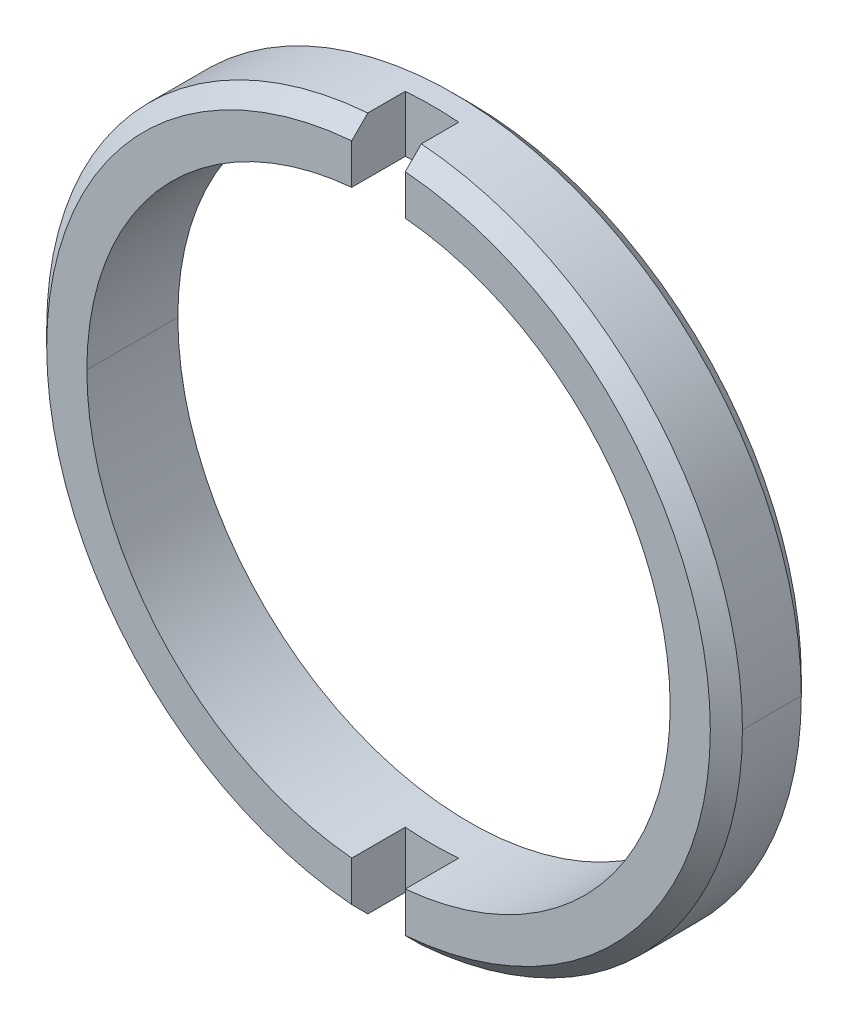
ISO-10303-21;
HEADER;
FILE_DESCRIPTION(('STEP AP214'),'2;1');
FILE_NAME('part.step','',(''),(''),'','','');
FILE_SCHEMA(('AUTOMOTIVE_DESIGN { 1 0 10303 214 1 1 1 1 }'));
ENDSEC;
DATA;
#1=APPLICATION_CONTEXT('core data for automotive mechanical design processes');
#2=APPLICATION_PROTOCOL_DEFINITION('international standard','automotive_design',2000,#1);
#3=PRODUCT_CONTEXT('',#1,'mechanical');
#4=PRODUCT('Part','Part','',(#3));
#5=PRODUCT_RELATED_PRODUCT_CATEGORY('part','',(#4));
#6=PRODUCT_DEFINITION_FORMATION('','',#4);
#7=PRODUCT_DEFINITION_CONTEXT('part definition',#1,'design');
#8=PRODUCT_DEFINITION('design','',#6,#7);
#9=PRODUCT_DEFINITION_SHAPE('','',#8);
#10=(LENGTH_UNIT() NAMED_UNIT(*) SI_UNIT(.MILLI.,.METRE.));
#11=(NAMED_UNIT(*) PLANE_ANGLE_UNIT() SI_UNIT($,.RADIAN.));
#12=(NAMED_UNIT(*) SI_UNIT($,.STERADIAN.) SOLID_ANGLE_UNIT());
#13=UNCERTAINTY_MEASURE_WITH_UNIT(LENGTH_MEASURE(1.E-05),#10,'distance_accuracy_value','');
#14=(GEOMETRIC_REPRESENTATION_CONTEXT(3) GLOBAL_UNCERTAINTY_ASSIGNED_CONTEXT((#13)) GLOBAL_UNIT_ASSIGNED_CONTEXT((#10,
#11,#12)) REPRESENTATION_CONTEXT('',''));
#15=CARTESIAN_POINT('',(0.,0.,0.));
#16=DIRECTION('',(0.,0.,1.));
#17=DIRECTION('',(1.,0.,0.));
#18=AXIS2_PLACEMENT_3D('',#15,#16,#17);
#19=CARTESIAN_POINT('',(0.,0.,1.7));
#20=DIRECTION('',(0.,0.,-1.));
#21=DIRECTION('',(-1.,0.,0.));
#22=AXIS2_PLACEMENT_3D('',#19,#20,#21);
#23=CONICAL_SURFACE('',#22,6.2,0.78539816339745);
#24=DIRECTION('',(-0.707106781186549,0.,-0.707106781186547));
#25=VECTOR('',#24,1.);
#26=CARTESIAN_POINT('',(-6.2,0.,1.7));
#27=LINE('',#26,#25);
#28=CARTESIAN_POINT('',(-6.2,0.,1.7));
#29=VERTEX_POINT('',#28);
#30=CARTESIAN_POINT('',(-6.5,0.,1.4));
#31=VERTEX_POINT('',#30);
#32=EDGE_CURVE('E280',#29,#31,#27,.T.);
#33=ORIENTED_EDGE('',*,*,#32,.F.);
#34=CARTESIAN_POINT('',(0.,0.,1.7));
#35=DIRECTION('',(0.,0.,1.));
#36=DIRECTION('',(1.,0.,0.));
#37=AXIS2_PLACEMENT_3D('',#34,#35,#36);
#38=CIRCLE('',#37,6.2);
#39=CARTESIAN_POINT('',(-0.5,6.17980582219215,1.7));
#40=VERTEX_POINT('',#39);
#41=EDGE_CURVE('E263',#40,#29,#38,.T.);
#42=ORIENTED_EDGE('',*,*,#41,.F.);
#43=CARTESIAN_POINT('',(-0.5,6.48074069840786,1.4));
#44=CARTESIAN_POINT('',(-0.5,6.38043627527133,1.5000072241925));
#45=CARTESIAN_POINT('',(-0.5,6.28012499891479,1.60000757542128));
#46=CARTESIAN_POINT('',(-0.5,6.17980582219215,1.7));
#47=(BOUNDED_CURVE() B_SPLINE_CURVE(3,(#43,#44,#45,#46),.UNSPECIFIED.,.F.,
.F.) B_SPLINE_CURVE_WITH_KNOTS((4,4),(0.,0.000424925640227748),
.UNSPECIFIED.) CURVE() GEOMETRIC_REPRESENTATION_ITEM() RATIONAL_B_SPLINE_CURVE((1.,1.,1.,1.)) REPRESENTATION_ITEM(''));
#48=CARTESIAN_POINT('',(-0.5,6.48074069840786,1.4));
#49=VERTEX_POINT('',#48);
#50=EDGE_CURVE('E179',#49,#40,#47,.T.);
#51=ORIENTED_EDGE('',*,*,#50,.F.);
#52=CARTESIAN_POINT('',(0.,0.,1.4));
#53=DIRECTION('',(0.,0.,-1.));
#54=DIRECTION('',(1.,0.,0.));
#55=AXIS2_PLACEMENT_3D('',#52,#53,#54);
#56=CIRCLE('',#55,6.5);
#57=EDGE_CURVE('E193',#31,#49,#56,.T.);
#58=ORIENTED_EDGE('',*,*,#57,.F.);
#59=EDGE_LOOP('',(#33,#42,#51,#58));
#60=FACE_BOUND('',#59,.T.);
#61=ADVANCED_FACE('F15',(#60),#23,.T.);
#62=CARTESIAN_POINT('',(0.,0.,1.7));
#63=DIRECTION('',(0.,0.,-1.));
#64=DIRECTION('',(-1.,0.,0.));
#65=AXIS2_PLACEMENT_3D('',#62,#63,#64);
#66=CONICAL_SURFACE('',#65,6.2,0.78539816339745);
#67=CARTESIAN_POINT('',(0.5,-6.48074069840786,1.4));
#68=CARTESIAN_POINT('',(0.5,-6.38043627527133,1.5000072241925));
#69=CARTESIAN_POINT('',(0.5,-6.28012499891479,1.60000757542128));
#70=CARTESIAN_POINT('',(0.5,-6.17980582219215,1.7));
#71=(BOUNDED_CURVE() B_SPLINE_CURVE(3,(#67,#68,#69,#70),.UNSPECIFIED.,.F.,
.F.) B_SPLINE_CURVE_WITH_KNOTS((4,4),(0.,0.000424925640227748),
.UNSPECIFIED.) CURVE() GEOMETRIC_REPRESENTATION_ITEM() RATIONAL_B_SPLINE_CURVE((1.,1.,1.,1.)) REPRESENTATION_ITEM(''));
#72=CARTESIAN_POINT('',(0.5,-6.48074069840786,1.4));
#73=VERTEX_POINT('',#72);
#74=CARTESIAN_POINT('',(0.5,-6.17980582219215,1.7));
#75=VERTEX_POINT('',#74);
#76=EDGE_CURVE('E19',#73,#75,#71,.T.);
#77=ORIENTED_EDGE('',*,*,#76,.F.);
#78=CARTESIAN_POINT('',(0.,0.,1.4));
#79=DIRECTION('',(0.,0.,-1.));
#80=DIRECTION('',(1.,0.,0.));
#81=AXIS2_PLACEMENT_3D('',#78,#79,#80);
#82=CIRCLE('',#81,6.5);
#83=CARTESIAN_POINT('',(6.5,0.,1.4));
#84=VERTEX_POINT('',#83);
#85=EDGE_CURVE('E211',#84,#73,#82,.T.);
#86=ORIENTED_EDGE('',*,*,#85,.F.);
#87=CARTESIAN_POINT('',(0.,0.,1.4));
#88=DIRECTION('',(0.,0.,-1.));
#89=DIRECTION('',(1.,0.,0.));
#90=AXIS2_PLACEMENT_3D('',#87,#88,#89);
#91=CIRCLE('',#90,6.5);
#92=CARTESIAN_POINT('',(0.5,6.48074069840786,1.4));
#93=VERTEX_POINT('',#92);
#94=EDGE_CURVE('E223',#93,#84,#91,.T.);
#95=ORIENTED_EDGE('',*,*,#94,.F.);
#96=CARTESIAN_POINT('',(0.5,6.17980582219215,1.7));
#97=CARTESIAN_POINT('',(0.5,6.28012499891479,1.60000757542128));
#98=CARTESIAN_POINT('',(0.5,6.38043627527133,1.5000072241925));
#99=CARTESIAN_POINT('',(0.5,6.48074069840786,1.4));
#100=(BOUNDED_CURVE() B_SPLINE_CURVE(3,(#96,#97,#98,#99),.UNSPECIFIED.,.F.,
.F.) B_SPLINE_CURVE_WITH_KNOTS((4,4),(0.,0.000424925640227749),
.UNSPECIFIED.) CURVE() GEOMETRIC_REPRESENTATION_ITEM() RATIONAL_B_SPLINE_CURVE((1.,1.,1.,1.)) REPRESENTATION_ITEM(''));
#101=CARTESIAN_POINT('',(0.5,6.17980582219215,1.7));
#102=VERTEX_POINT('',#101);
#103=EDGE_CURVE('E178',#102,#93,#100,.T.);
#104=ORIENTED_EDGE('',*,*,#103,.F.);
#105=CARTESIAN_POINT('',(0.,0.,1.7));
#106=DIRECTION('',(0.,0.,1.));
#107=DIRECTION('',(1.,0.,0.));
#108=AXIS2_PLACEMENT_3D('',#105,#106,#107);
#109=CIRCLE('',#108,6.2);
#110=EDGE_CURVE('E228',#75,#102,#109,.T.);
#111=ORIENTED_EDGE('',*,*,#110,.F.);
#112=EDGE_LOOP('',(#77,#86,#95,#104,#111));
#113=FACE_BOUND('',#112,.T.);
#114=ADVANCED_FACE('F386',(#113),#66,.T.);
#115=CARTESIAN_POINT('',(0.,0.,0.3));
#116=DIRECTION('',(0.,0.,1.));
#117=DIRECTION('',(1.,0.,0.));
#118=AXIS2_PLACEMENT_3D('',#115,#116,#117);
#119=CONICAL_SURFACE('',#118,6.5,0.785398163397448);
#120=DIRECTION('',(-0.707106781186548,0.,0.707106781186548));
#121=VECTOR('',#120,1.);
#122=CARTESIAN_POINT('',(-6.5,0.,0.3));
#123=LINE('',#122,#121);
#124=CARTESIAN_POINT('',(-6.2,0.,0.));
#125=VERTEX_POINT('',#124);
#126=CARTESIAN_POINT('',(-6.5,0.,0.3));
#127=VERTEX_POINT('',#126);
#128=EDGE_CURVE('E222',#125,#127,#123,.T.);
#129=ORIENTED_EDGE('',*,*,#128,.F.);
#130=CARTESIAN_POINT('',(0.,0.,0.));
#131=DIRECTION('',(0.,0.,-1.));
#132=DIRECTION('',(1.,0.,0.));
#133=AXIS2_PLACEMENT_3D('',#130,#131,#132);
#134=CIRCLE('',#133,6.2);
#135=CARTESIAN_POINT('',(6.2,0.,0.));
#136=VERTEX_POINT('',#135);
#137=EDGE_CURVE('E233',#136,#125,#134,.T.);
#138=ORIENTED_EDGE('',*,*,#137,.F.);
#139=DIRECTION('',(0.707106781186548,0.,0.707106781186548));
#140=VECTOR('',#139,1.);
#141=CARTESIAN_POINT('',(6.5,0.,0.3));
#142=LINE('',#141,#140);
#143=CARTESIAN_POINT('',(6.5,0.,0.3));
#144=VERTEX_POINT('',#143);
#145=EDGE_CURVE('E221',#136,#144,#142,.T.);
#146=ORIENTED_EDGE('',*,*,#145,.T.);
#147=CARTESIAN_POINT('',(0.,0.,0.3));
#148=DIRECTION('',(0.,0.,1.));
#149=DIRECTION('',(1.,0.,0.));
#150=AXIS2_PLACEMENT_3D('',#147,#148,#149);
#151=CIRCLE('',#150,6.5);
#152=EDGE_CURVE('E316',#127,#144,#151,.T.);
#153=ORIENTED_EDGE('',*,*,#152,.F.);
#154=EDGE_LOOP('',(#129,#138,#146,#153));
#155=FACE_BOUND('',#154,.T.);
#156=ADVANCED_FACE('F395',(#155),#119,.T.);
#157=CARTESIAN_POINT('',(0.,0.,0.7));
#158=DIRECTION('',(0.,0.,1.));
#159=DIRECTION('',(1.,0.,0.));
#160=AXIS2_PLACEMENT_3D('',#157,#158,#159);
#161=PLANE('',#160);
#162=CARTESIAN_POINT('',(0.,0.,0.7));
#163=DIRECTION('',(0.,0.,1.));
#164=DIRECTION('',(1.,0.,0.));
#165=AXIS2_PLACEMENT_3D('',#162,#163,#164);
#166=CIRCLE('',#165,6.5);
#167=CARTESIAN_POINT('',(-0.5,-6.48074069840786,0.7));
#168=VERTEX_POINT('',#167);
#169=CARTESIAN_POINT('',(0.5,-6.48074069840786,0.7));
#170=VERTEX_POINT('',#169);
#171=EDGE_CURVE('E253',#168,#170,#166,.T.);
#172=ORIENTED_EDGE('',*,*,#171,.T.);
#173=DIRECTION('',(0.,-1.,0.));
#174=VECTOR('',#173,1.);
#175=CARTESIAN_POINT('',(0.5,-6.5,0.7));
#176=LINE('',#175,#174);
#177=CARTESIAN_POINT('',(0.5,-5.42701575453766,0.7));
#178=VERTEX_POINT('',#177);
#179=EDGE_CURVE('E10',#178,#170,#176,.T.);
#180=ORIENTED_EDGE('',*,*,#179,.F.);
#181=CARTESIAN_POINT('',(0.,0.,0.7));
#182=DIRECTION('',(0.,0.,1.));
#183=DIRECTION('',(1.,0.,0.));
#184=AXIS2_PLACEMENT_3D('',#181,#182,#183);
#185=CIRCLE('',#184,5.45);
#186=CARTESIAN_POINT('',(-0.5,-5.42701575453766,0.7));
#187=VERTEX_POINT('',#186);
#188=EDGE_CURVE('E294',#187,#178,#185,.T.);
#189=ORIENTED_EDGE('',*,*,#188,.F.);
#190=DIRECTION('',(0.,1.,0.));
#191=VECTOR('',#190,1.);
#192=CARTESIAN_POINT('',(-0.5,-6.5,0.7));
#193=LINE('',#192,#191);
#194=EDGE_CURVE('E270',#168,#187,#193,.T.);
#195=ORIENTED_EDGE('',*,*,#194,.F.);
#196=EDGE_LOOP('',(#172,#180,#189,#195));
#197=FACE_BOUND('',#196,.T.);
#198=ADVANCED_FACE('F439',(#197),#161,.T.);
#199=CARTESIAN_POINT('',(0.5,-6.5,0.7));
#200=DIRECTION('',(-1.,0.,0.));
#201=DIRECTION('',(0.,0.,1.));
#202=AXIS2_PLACEMENT_3D('',#199,#200,#201);
#203=PLANE('',#202);
#204=DIRECTION('',(0.,0.,1.));
#205=VECTOR('',#204,1.);
#206=CARTESIAN_POINT('',(0.5,-6.48074069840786,1.7));
#207=LINE('',#206,#205);
#208=EDGE_CURVE('E216',#170,#73,#207,.T.);
#209=ORIENTED_EDGE('',*,*,#208,.T.);
#210=ORIENTED_EDGE('',*,*,#76,.T.);
#211=DIRECTION('',(0.,-1.,0.));
#212=VECTOR('',#211,1.);
#213=CARTESIAN_POINT('',(0.5,-6.5,1.7));
#214=LINE('',#213,#212);
#215=CARTESIAN_POINT('',(0.5,-5.42701575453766,1.7));
#216=VERTEX_POINT('',#215);
#217=EDGE_CURVE('E232',#216,#75,#214,.T.);
#218=ORIENTED_EDGE('',*,*,#217,.F.);
#219=DIRECTION('',(0.,0.,1.));
#220=VECTOR('',#219,1.);
#221=CARTESIAN_POINT('',(0.5,-5.42701575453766,1.7));
#222=LINE('',#221,#220);
#223=EDGE_CURVE('E227',#178,#216,#222,.T.);
#224=ORIENTED_EDGE('',*,*,#223,.F.);
#225=ORIENTED_EDGE('',*,*,#179,.T.);
#226=EDGE_LOOP('',(#209,#210,#218,#224,#225));
#227=FACE_BOUND('',#226,.T.);
#228=ADVANCED_FACE('F436',(#227),#203,.T.);
#229=CARTESIAN_POINT('',(-0.5,-6.5,0.7));
#230=DIRECTION('',(1.,0.,0.));
#231=DIRECTION('',(0.,-1.,0.));
#232=AXIS2_PLACEMENT_3D('',#229,#230,#231);
#233=PLANE('',#232);
#234=DIRECTION('',(0.,1.,0.));
#235=VECTOR('',#234,1.);
#236=CARTESIAN_POINT('',(-0.5,-6.5,1.7));
#237=LINE('',#236,#235);
#238=CARTESIAN_POINT('',(-0.5,-6.17980582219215,1.7));
#239=VERTEX_POINT('',#238);
#240=CARTESIAN_POINT('',(-0.5,-5.42701575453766,1.7));
#241=VERTEX_POINT('',#240);
#242=EDGE_CURVE('E289',#239,#241,#237,.T.);
#243=ORIENTED_EDGE('',*,*,#242,.F.);
#244=CARTESIAN_POINT('',(-0.5,-6.17980582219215,1.7));
#245=CARTESIAN_POINT('',(-0.5,-6.28012499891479,1.60000757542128));
#246=CARTESIAN_POINT('',(-0.5,-6.38043627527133,1.5000072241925));
#247=CARTESIAN_POINT('',(-0.5,-6.48074069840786,1.4));
#248=(BOUNDED_CURVE() B_SPLINE_CURVE(3,(#244,#245,#246,#247),.UNSPECIFIED.,.F.,
.F.) B_SPLINE_CURVE_WITH_KNOTS((4,4),(0.,0.000424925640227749),
.UNSPECIFIED.) CURVE() GEOMETRIC_REPRESENTATION_ITEM() RATIONAL_B_SPLINE_CURVE((1.,1.,1.,1.)) REPRESENTATION_ITEM(''));
#249=CARTESIAN_POINT('',(-0.5,-6.48074069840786,1.4));
#250=VERTEX_POINT('',#249);
#251=EDGE_CURVE('E204',#239,#250,#248,.T.);
#252=ORIENTED_EDGE('',*,*,#251,.T.);
#253=DIRECTION('',(0.,0.,-1.));
#254=VECTOR('',#253,1.);
#255=CARTESIAN_POINT('',(-0.5,-6.48074069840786,1.7));
#256=LINE('',#255,#254);
#257=EDGE_CURVE('E257',#250,#168,#256,.T.);
#258=ORIENTED_EDGE('',*,*,#257,.T.);
#259=ORIENTED_EDGE('',*,*,#194,.T.);
#260=DIRECTION('',(0.,0.,-1.));
#261=VECTOR('',#260,1.);
#262=CARTESIAN_POINT('',(-0.5,-5.42701575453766,1.7));
#263=LINE('',#262,#261);
#264=EDGE_CURVE('E298',#241,#187,#263,.T.);
#265=ORIENTED_EDGE('',*,*,#264,.F.);
#266=EDGE_LOOP('',(#243,#252,#258,#259,#265));
#267=FACE_BOUND('',#266,.T.);
#268=ADVANCED_FACE('F17',(#267),#233,.T.);
#269=CARTESIAN_POINT('',(0.,0.,0.7));
#270=DIRECTION('',(0.,0.,1.));
#271=DIRECTION('',(1.,0.,0.));
#272=AXIS2_PLACEMENT_3D('',#269,#270,#271);
#273=PLANE('',#272);
#274=CARTESIAN_POINT('',(0.,0.,0.7));
#275=DIRECTION('',(0.,0.,1.));
#276=DIRECTION('',(1.,0.,0.));
#277=AXIS2_PLACEMENT_3D('',#274,#275,#276);
#278=CIRCLE('',#277,6.5);
#279=CARTESIAN_POINT('',(0.5,6.48074069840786,0.7));
#280=VERTEX_POINT('',#279);
#281=CARTESIAN_POINT('',(-0.5,6.48074069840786,0.7));
#282=VERTEX_POINT('',#281);
#283=EDGE_CURVE('E182',#280,#282,#278,.T.);
#284=ORIENTED_EDGE('',*,*,#283,.T.);
#285=DIRECTION('',(0.,-1.,0.));
#286=VECTOR('',#285,1.);
#287=CARTESIAN_POINT('',(-0.5,6.5,0.7));
#288=LINE('',#287,#286);
#289=CARTESIAN_POINT('',(-0.5,5.42701575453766,0.7));
#290=VERTEX_POINT('',#289);
#291=EDGE_CURVE('E42',#282,#290,#288,.T.);
#292=ORIENTED_EDGE('',*,*,#291,.T.);
#293=CARTESIAN_POINT('',(0.,0.,0.7));
#294=DIRECTION('',(0.,0.,1.));
#295=DIRECTION('',(1.,0.,0.));
#296=AXIS2_PLACEMENT_3D('',#293,#294,#295);
#297=CIRCLE('',#296,5.45);
#298=CARTESIAN_POINT('',(0.5,5.42701575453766,0.7));
#299=VERTEX_POINT('',#298);
#300=EDGE_CURVE('E246',#299,#290,#297,.T.);
#301=ORIENTED_EDGE('',*,*,#300,.F.);
#302=DIRECTION('',(0.,1.,0.));
#303=VECTOR('',#302,1.);
#304=CARTESIAN_POINT('',(0.5,6.5,0.7));
#305=LINE('',#304,#303);
#306=EDGE_CURVE('E163',#299,#280,#305,.T.);
#307=ORIENTED_EDGE('',*,*,#306,.T.);
#308=EDGE_LOOP('',(#284,#292,#301,#307));
#309=FACE_BOUND('',#308,.T.);
#310=ADVANCED_FACE('F183',(#309),#273,.T.);
#311=CARTESIAN_POINT('',(0.5,6.5,0.7));
#312=DIRECTION('',(1.,0.,0.));
#313=DIRECTION('',(0.,1.,0.));
#314=AXIS2_PLACEMENT_3D('',#311,#312,#313);
#315=PLANE('',#314);
#316=DIRECTION('',(0.,1.,0.));
#317=VECTOR('',#316,1.);
#318=CARTESIAN_POINT('',(0.5,6.5,1.7));
#319=LINE('',#318,#317);
#320=CARTESIAN_POINT('',(0.5,5.42701575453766,1.7));
#321=VERTEX_POINT('',#320);
#322=EDGE_CURVE('E212',#321,#102,#319,.T.);
#323=ORIENTED_EDGE('',*,*,#322,.T.);
#324=ORIENTED_EDGE('',*,*,#103,.T.);
#325=DIRECTION('',(0.,0.,1.));
#326=VECTOR('',#325,1.);
#327=CARTESIAN_POINT('',(0.5,6.48074069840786,1.7));
#328=LINE('',#327,#326);
#329=EDGE_CURVE('E187',#280,#93,#328,.T.);
#330=ORIENTED_EDGE('',*,*,#329,.F.);
#331=ORIENTED_EDGE('',*,*,#306,.F.);
#332=DIRECTION('',(0.,0.,1.));
#333=VECTOR('',#332,1.);
#334=CARTESIAN_POINT('',(0.5,5.42701575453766,1.7));
#335=LINE('',#334,#333);
#336=EDGE_CURVE('E142',#299,#321,#335,.T.);
#337=ORIENTED_EDGE('',*,*,#336,.T.);
#338=EDGE_LOOP('',(#323,#324,#330,#331,#337));
#339=FACE_BOUND('',#338,.T.);
#340=ADVANCED_FACE('F407',(#339),#315,.F.);
#341=CARTESIAN_POINT('',(-0.5,6.5,0.7));
#342=DIRECTION('',(-1.,0.,0.));
#343=DIRECTION('',(0.,1.,0.));
#344=AXIS2_PLACEMENT_3D('',#341,#342,#343);
#345=PLANE('',#344);
#346=DIRECTION('',(0.,0.,-1.));
#347=VECTOR('',#346,1.);
#348=CARTESIAN_POINT('',(-0.5,6.48074069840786,1.7));
#349=LINE('',#348,#347);
#350=EDGE_CURVE('E172',#49,#282,#349,.T.);
#351=ORIENTED_EDGE('',*,*,#350,.F.);
#352=ORIENTED_EDGE('',*,*,#50,.T.);
#353=DIRECTION('',(0.,-1.,0.));
#354=VECTOR('',#353,1.);
#355=CARTESIAN_POINT('',(-0.5,6.5,1.7));
#356=LINE('',#355,#354);
#357=CARTESIAN_POINT('',(-0.5,5.42701575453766,1.7));
#358=VERTEX_POINT('',#357);
#359=EDGE_CURVE('E261',#40,#358,#356,.T.);
#360=ORIENTED_EDGE('',*,*,#359,.T.);
#361=DIRECTION('',(0.,0.,-1.));
#362=VECTOR('',#361,1.);
#363=CARTESIAN_POINT('',(-0.5,5.42701575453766,1.7));
#364=LINE('',#363,#362);
#365=EDGE_CURVE('E175',#358,#290,#364,.T.);
#366=ORIENTED_EDGE('',*,*,#365,.T.);
#367=ORIENTED_EDGE('',*,*,#291,.F.);
#368=EDGE_LOOP('',(#351,#352,#360,#366,#367));
#369=FACE_BOUND('',#368,.T.);
#370=ADVANCED_FACE('F170',(#369),#345,.F.);
#371=CARTESIAN_POINT('',(0.,0.,0.));
#372=DIRECTION('',(0.,0.,1.));
#373=DIRECTION('',(1.,0.,0.));
#374=AXIS2_PLACEMENT_3D('',#371,#372,#373);
#375=PLANE('',#374);
#376=CARTESIAN_POINT('',(0.,0.,0.));
#377=DIRECTION('',(0.,0.,1.));
#378=DIRECTION('',(1.,0.,0.));
#379=AXIS2_PLACEMENT_3D('',#376,#377,#378);
#380=CIRCLE('',#379,5.45);
#381=CARTESIAN_POINT('',(-5.45,0.,0.));
#382=VERTEX_POINT('',#381);
#383=CARTESIAN_POINT('',(5.45,0.,0.));
#384=VERTEX_POINT('',#383);
#385=EDGE_CURVE('E307',#382,#384,#380,.T.);
#386=ORIENTED_EDGE('',*,*,#385,.T.);
#387=CARTESIAN_POINT('',(0.,0.,0.));
#388=DIRECTION('',(0.,0.,1.));
#389=DIRECTION('',(1.,0.,0.));
#390=AXIS2_PLACEMENT_3D('',#387,#388,#389);
#391=CIRCLE('',#390,5.45);
#392=EDGE_CURVE('E236',#384,#382,#391,.T.);
#393=ORIENTED_EDGE('',*,*,#392,.T.);
#394=EDGE_LOOP('',(#386,#393));
#395=FACE_BOUND('',#394,.T.);
#396=ORIENTED_EDGE('',*,*,#137,.T.);
#397=CARTESIAN_POINT('',(0.,0.,0.));
#398=DIRECTION('',(0.,0.,-1.));
#399=DIRECTION('',(1.,0.,0.));
#400=AXIS2_PLACEMENT_3D('',#397,#398,#399);
#401=CIRCLE('',#400,6.2);
#402=EDGE_CURVE('E240',#125,#136,#401,.T.);
#403=ORIENTED_EDGE('',*,*,#402,.T.);
#404=EDGE_LOOP('',(#396,#403));
#405=FACE_BOUND('',#404,.T.);
#406=ADVANCED_FACE('F354',(#395,#405),#375,.F.);
#407=CARTESIAN_POINT('',(0.,0.,1.7));
#408=DIRECTION('',(0.,0.,-1.));
#409=DIRECTION('',(-1.,0.,0.));
#410=AXIS2_PLACEMENT_3D('',#407,#408,#409);
#411=CYLINDRICAL_SURFACE('',#410,5.45);
#412=DIRECTION('',(0.,0.,-1.));
#413=VECTOR('',#412,1.);
#414=CARTESIAN_POINT('',(5.45,0.,1.7));
#415=LINE('',#414,#413);
#416=CARTESIAN_POINT('',(5.45,0.,1.7));
#417=VERTEX_POINT('',#416);
#418=EDGE_CURVE('E285',#417,#384,#415,.T.);
#419=ORIENTED_EDGE('',*,*,#418,.F.);
#420=CARTESIAN_POINT('',(0.,0.,1.7));
#421=DIRECTION('',(0.,0.,1.));
#422=DIRECTION('',(1.,0.,0.));
#423=AXIS2_PLACEMENT_3D('',#420,#421,#422);
#424=CIRCLE('',#423,5.45);
#425=EDGE_CURVE('E208',#417,#321,#424,.T.);
#426=ORIENTED_EDGE('',*,*,#425,.T.);
#427=ORIENTED_EDGE('',*,*,#336,.F.);
#428=ORIENTED_EDGE('',*,*,#300,.T.);
#429=ORIENTED_EDGE('',*,*,#365,.F.);
#430=CARTESIAN_POINT('',(0.,0.,1.7));
#431=DIRECTION('',(0.,0.,1.));
#432=DIRECTION('',(1.,0.,0.));
#433=AXIS2_PLACEMENT_3D('',#430,#431,#432);
#434=CIRCLE('',#433,5.45);
#435=CARTESIAN_POINT('',(-5.45,0.,1.7));
#436=VERTEX_POINT('',#435);
#437=EDGE_CURVE('E250',#358,#436,#434,.T.);
#438=ORIENTED_EDGE('',*,*,#437,.T.);
#439=DIRECTION('',(0.,0.,-1.));
#440=VECTOR('',#439,1.);
#441=CARTESIAN_POINT('',(-5.45,0.,1.7));
#442=LINE('',#441,#440);
#443=EDGE_CURVE('E302',#436,#382,#442,.T.);
#444=ORIENTED_EDGE('',*,*,#443,.T.);
#445=ORIENTED_EDGE('',*,*,#392,.F.);
#446=EDGE_LOOP('',(#419,#426,#427,#428,#429,#438,#444,#445));
#447=FACE_BOUND('',#446,.T.);
#448=ADVANCED_FACE('F349',(#447),#411,.F.);
#449=CARTESIAN_POINT('',(0.,0.,1.7));
#450=DIRECTION('',(0.,0.,-1.));
#451=DIRECTION('',(-1.,0.,0.));
#452=AXIS2_PLACEMENT_3D('',#449,#450,#451);
#453=CYLINDRICAL_SURFACE('',#452,6.5);
#454=DIRECTION('',(0.,0.,-1.));
#455=VECTOR('',#454,1.);
#456=CARTESIAN_POINT('',(6.5,0.,1.7));
#457=LINE('',#456,#455);
#458=EDGE_CURVE('E226',#84,#144,#457,.T.);
#459=ORIENTED_EDGE('',*,*,#458,.F.);
#460=ORIENTED_EDGE('',*,*,#85,.T.);
#461=ORIENTED_EDGE('',*,*,#208,.F.);
#462=ORIENTED_EDGE('',*,*,#171,.F.);
#463=ORIENTED_EDGE('',*,*,#257,.F.);
#464=CARTESIAN_POINT('',(0.,0.,1.4));
#465=DIRECTION('',(0.,0.,-1.));
#466=DIRECTION('',(1.,0.,0.));
#467=AXIS2_PLACEMENT_3D('',#464,#465,#466);
#468=CIRCLE('',#467,6.5);
#469=EDGE_CURVE('E276',#250,#31,#468,.T.);
#470=ORIENTED_EDGE('',*,*,#469,.T.);
#471=DIRECTION('',(0.,0.,-1.));
#472=VECTOR('',#471,1.);
#473=CARTESIAN_POINT('',(-6.5,0.,1.7));
#474=LINE('',#473,#472);
#475=EDGE_CURVE('E200',#31,#127,#474,.T.);
#476=ORIENTED_EDGE('',*,*,#475,.T.);
#477=ORIENTED_EDGE('',*,*,#152,.T.);
#478=EDGE_LOOP('',(#459,#460,#461,#462,#463,#470,#476,#477));
#479=FACE_BOUND('',#478,.T.);
#480=ADVANCED_FACE('F390',(#479),#453,.T.);
#481=CARTESIAN_POINT('',(0.,0.,1.7));
#482=DIRECTION('',(0.,0.,1.));
#483=DIRECTION('',(1.,0.,0.));
#484=AXIS2_PLACEMENT_3D('',#481,#482,#483);
#485=PLANE('',#484);
#486=ORIENTED_EDGE('',*,*,#217,.T.);
#487=ORIENTED_EDGE('',*,*,#110,.T.);
#488=ORIENTED_EDGE('',*,*,#322,.F.);
#489=ORIENTED_EDGE('',*,*,#425,.F.);
#490=CARTESIAN_POINT('',(0.,0.,1.7));
#491=DIRECTION('',(0.,0.,1.));
#492=DIRECTION('',(1.,0.,0.));
#493=AXIS2_PLACEMENT_3D('',#490,#491,#492);
#494=CIRCLE('',#493,5.45);
#495=EDGE_CURVE('E281',#216,#417,#494,.T.);
#496=ORIENTED_EDGE('',*,*,#495,.F.);
#497=EDGE_LOOP('',(#486,#487,#488,#489,#496));
#498=FACE_BOUND('',#497,.T.);
#499=ADVANCED_FACE('F345',(#498),#485,.T.);
#500=CARTESIAN_POINT('',(0.,0.,1.7));
#501=DIRECTION('',(0.,0.,1.));
#502=DIRECTION('',(1.,0.,0.));
#503=AXIS2_PLACEMENT_3D('',#500,#501,#502);
#504=PLANE('',#503);
#505=ORIENTED_EDGE('',*,*,#359,.F.);
#506=ORIENTED_EDGE('',*,*,#41,.T.);
#507=CARTESIAN_POINT('',(0.,0.,1.7));
#508=DIRECTION('',(0.,0.,1.));
#509=DIRECTION('',(1.,0.,0.));
#510=AXIS2_PLACEMENT_3D('',#507,#508,#509);
#511=CIRCLE('',#510,6.2);
#512=EDGE_CURVE('E375',#29,#239,#511,.T.);
#513=ORIENTED_EDGE('',*,*,#512,.T.);
#514=ORIENTED_EDGE('',*,*,#242,.T.);
#515=CARTESIAN_POINT('',(0.,0.,1.7));
#516=DIRECTION('',(0.,0.,1.));
#517=DIRECTION('',(1.,0.,0.));
#518=AXIS2_PLACEMENT_3D('',#515,#516,#517);
#519=CIRCLE('',#518,5.45);
#520=EDGE_CURVE('E306',#436,#241,#519,.T.);
#521=ORIENTED_EDGE('',*,*,#520,.F.);
#522=ORIENTED_EDGE('',*,*,#437,.F.);
#523=EDGE_LOOP('',(#505,#506,#513,#514,#521,#522));
#524=FACE_BOUND('',#523,.T.);
#525=ADVANCED_FACE('F363',(#524),#504,.T.);
#526=CARTESIAN_POINT('',(0.,0.,1.7));
#527=DIRECTION('',(0.,0.,-1.));
#528=DIRECTION('',(-1.,0.,0.));
#529=AXIS2_PLACEMENT_3D('',#526,#527,#528);
#530=CYLINDRICAL_SURFACE('',#529,6.5);
#531=ORIENTED_EDGE('',*,*,#94,.T.);
#532=ORIENTED_EDGE('',*,*,#458,.T.);
#533=CARTESIAN_POINT('',(0.,0.,0.3));
#534=DIRECTION('',(0.,0.,1.));
#535=DIRECTION('',(1.,0.,0.));
#536=AXIS2_PLACEMENT_3D('',#533,#534,#535);
#537=CIRCLE('',#536,6.5);
#538=EDGE_CURVE('E217',#144,#127,#537,.T.);
#539=ORIENTED_EDGE('',*,*,#538,.T.);
#540=ORIENTED_EDGE('',*,*,#475,.F.);
#541=ORIENTED_EDGE('',*,*,#57,.T.);
#542=ORIENTED_EDGE('',*,*,#350,.T.);
#543=ORIENTED_EDGE('',*,*,#283,.F.);
#544=ORIENTED_EDGE('',*,*,#329,.T.);
#545=EDGE_LOOP('',(#531,#532,#539,#540,#541,#542,#543,#544));
#546=FACE_BOUND('',#545,.T.);
#547=ADVANCED_FACE('F190',(#546),#530,.T.);
#548=CARTESIAN_POINT('',(0.,0.,1.7));
#549=DIRECTION('',(0.,0.,-1.));
#550=DIRECTION('',(-1.,0.,0.));
#551=AXIS2_PLACEMENT_3D('',#548,#549,#550);
#552=CYLINDRICAL_SURFACE('',#551,5.45);
#553=ORIENTED_EDGE('',*,*,#495,.T.);
#554=ORIENTED_EDGE('',*,*,#418,.T.);
#555=ORIENTED_EDGE('',*,*,#385,.F.);
#556=ORIENTED_EDGE('',*,*,#443,.F.);
#557=ORIENTED_EDGE('',*,*,#520,.T.);
#558=ORIENTED_EDGE('',*,*,#264,.T.);
#559=ORIENTED_EDGE('',*,*,#188,.T.);
#560=ORIENTED_EDGE('',*,*,#223,.T.);
#561=EDGE_LOOP('',(#553,#554,#555,#556,#557,#558,#559,#560));
#562=FACE_BOUND('',#561,.T.);
#563=ADVANCED_FACE('F340',(#562),#552,.F.);
#564=CARTESIAN_POINT('',(0.,0.,0.3));
#565=DIRECTION('',(0.,0.,1.));
#566=DIRECTION('',(1.,0.,0.));
#567=AXIS2_PLACEMENT_3D('',#564,#565,#566);
#568=CONICAL_SURFACE('',#567,6.5,0.785398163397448);
#569=ORIENTED_EDGE('',*,*,#402,.F.);
#570=ORIENTED_EDGE('',*,*,#128,.T.);
#571=ORIENTED_EDGE('',*,*,#538,.F.);
#572=ORIENTED_EDGE('',*,*,#145,.F.);
#573=EDGE_LOOP('',(#569,#570,#571,#572));
#574=FACE_BOUND('',#573,.T.);
#575=ADVANCED_FACE('F398',(#574),#568,.T.);
#576=CARTESIAN_POINT('',(0.,0.,1.7));
#577=DIRECTION('',(0.,0.,-1.));
#578=DIRECTION('',(-1.,0.,0.));
#579=AXIS2_PLACEMENT_3D('',#576,#577,#578);
#580=CONICAL_SURFACE('',#579,6.2,0.78539816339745);
#581=ORIENTED_EDGE('',*,*,#512,.F.);
#582=ORIENTED_EDGE('',*,*,#32,.T.);
#583=ORIENTED_EDGE('',*,*,#469,.F.);
#584=ORIENTED_EDGE('',*,*,#251,.F.);
#585=EDGE_LOOP('',(#581,#582,#583,#584));
#586=FACE_BOUND('',#585,.T.);
#587=ADVANCED_FACE('F429',(#586),#580,.T.);
#588=CLOSED_SHELL('',(#61,#114,#156,#198,#228,#268,#310,#340,#370,#406,#448,#480,#499,#525,#547,
#563,#575,#587));
#589=MANIFOLD_SOLID_BREP('B1',#588);
#590=ADVANCED_BREP_SHAPE_REPRESENTATION('',(#18,#589),#14);
#591=SHAPE_DEFINITION_REPRESENTATION(#9,#590);
ENDSEC;
END-ISO-10303-21;
